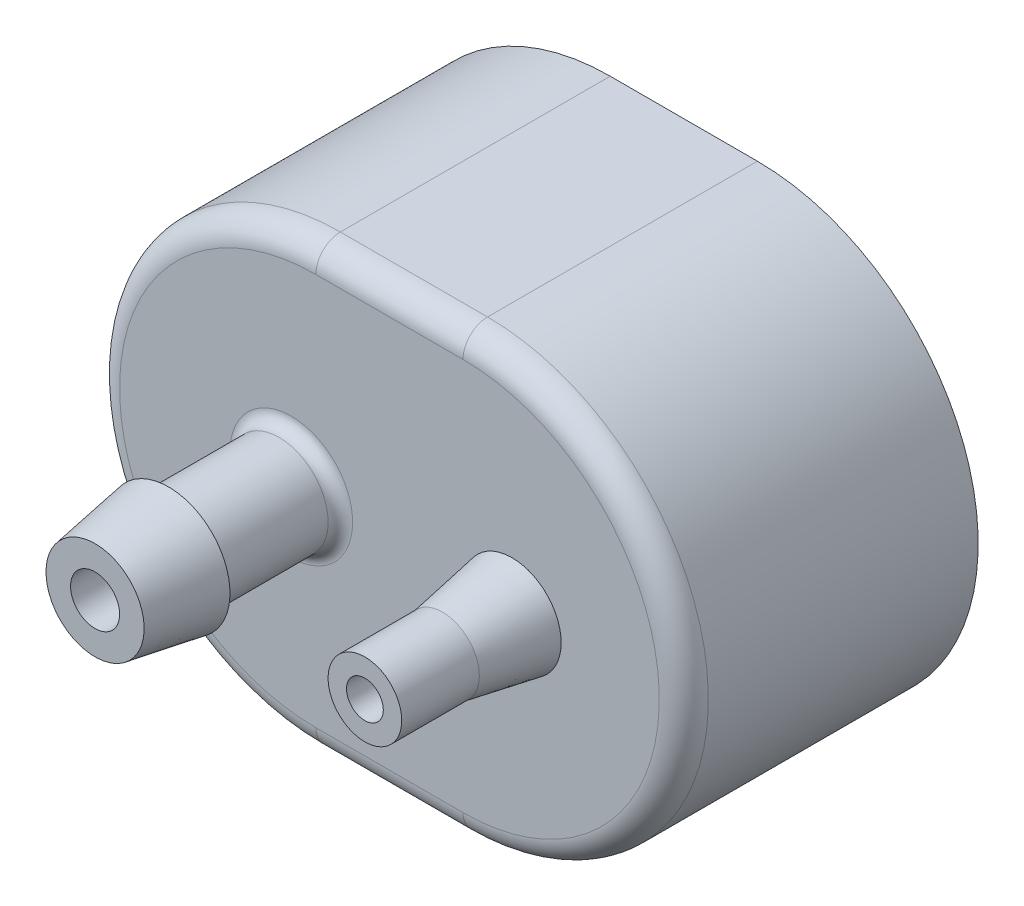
ISO-10303-21;
HEADER;
FILE_DESCRIPTION(('STEP AP214'),'2;1');
FILE_NAME('part.step','',(''),(''),'','','');
FILE_SCHEMA(('AUTOMOTIVE_DESIGN { 1 0 10303 214 1 1 1 1 }'));
ENDSEC;
DATA;
#1=APPLICATION_CONTEXT('core data for automotive mechanical design processes');
#2=APPLICATION_PROTOCOL_DEFINITION('international standard','automotive_design',2000,#1);
#3=PRODUCT_CONTEXT('',#1,'mechanical');
#4=PRODUCT('Part','Part','',(#3));
#5=PRODUCT_RELATED_PRODUCT_CATEGORY('part','',(#4));
#6=PRODUCT_DEFINITION_FORMATION('','',#4);
#7=PRODUCT_DEFINITION_CONTEXT('part definition',#1,'design');
#8=PRODUCT_DEFINITION('design','',#6,#7);
#9=PRODUCT_DEFINITION_SHAPE('','',#8);
#10=(LENGTH_UNIT() NAMED_UNIT(*) SI_UNIT(.MILLI.,.METRE.));
#11=(NAMED_UNIT(*) PLANE_ANGLE_UNIT() SI_UNIT($,.RADIAN.));
#12=(NAMED_UNIT(*) SI_UNIT($,.STERADIAN.) SOLID_ANGLE_UNIT());
#13=UNCERTAINTY_MEASURE_WITH_UNIT(LENGTH_MEASURE(1.E-05),#10,'distance_accuracy_value','');
#14=(GEOMETRIC_REPRESENTATION_CONTEXT(3) GLOBAL_UNCERTAINTY_ASSIGNED_CONTEXT((#13)) GLOBAL_UNIT_ASSIGNED_CONTEXT((#10,
#11,#12)) REPRESENTATION_CONTEXT('',''));
#15=CARTESIAN_POINT('',(0.,0.,0.));
#16=DIRECTION('',(0.,0.,1.));
#17=DIRECTION('',(1.,0.,0.));
#18=AXIS2_PLACEMENT_3D('',#15,#16,#17);
#19=CARTESIAN_POINT('',(8.00000000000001,0.,11.));
#20=DIRECTION('',(0.,0.,-1.));
#21=DIRECTION('',(-1.,0.,0.));
#22=AXIS2_PLACEMENT_3D('',#19,#20,#21);
#23=PLANE('',#22);
#24=CARTESIAN_POINT('',(8.00000000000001,0.,11.));
#25=DIRECTION('',(0.,0.,-1.));
#26=DIRECTION('',(-1.,0.,0.));
#27=AXIS2_PLACEMENT_3D('',#24,#25,#26);
#28=CIRCLE('',#27,0.75);
#29=CARTESIAN_POINT('',(8.70710678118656,0.25,11.));
#30=VERTEX_POINT('',#29);
#31=CARTESIAN_POINT('',(8.25000000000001,0.707106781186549,11.));
#32=VERTEX_POINT('',#31);
#33=EDGE_CURVE('E520',#30,#32,#28,.F.);
#34=ORIENTED_EDGE('',*,*,#33,.T.);
#35=DIRECTION('',(0.,-1.,0.));
#36=VECTOR('',#35,1.);
#37=CARTESIAN_POINT('',(8.25000000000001,0.70710678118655,11.));
#38=LINE('',#37,#36);
#39=CARTESIAN_POINT('',(8.25,1.98431348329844,11.));
#40=VERTEX_POINT('',#39);
#41=EDGE_CURVE('E51',#40,#32,#38,.T.);
#42=ORIENTED_EDGE('',*,*,#41,.F.);
#43=CARTESIAN_POINT('',(8.00000000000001,0.,11.));
#44=DIRECTION('',(0.,0.,-1.));
#45=DIRECTION('',(-1.,0.,0.));
#46=AXIS2_PLACEMENT_3D('',#43,#44,#45);
#47=CIRCLE('',#46,2.);
#48=CARTESIAN_POINT('',(9.98431348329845,0.25,11.));
#49=VERTEX_POINT('',#48);
#50=EDGE_CURVE('E240',#40,#49,#47,.T.);
#51=ORIENTED_EDGE('',*,*,#50,.T.);
#52=DIRECTION('',(1.,0.,0.));
#53=VECTOR('',#52,1.);
#54=CARTESIAN_POINT('',(8.70710678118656,0.25,11.));
#55=LINE('',#54,#53);
#56=EDGE_CURVE('E290',#30,#49,#55,.T.);
#57=ORIENTED_EDGE('',*,*,#56,.F.);
#58=EDGE_LOOP('',(#34,#42,#51,#57));
#59=FACE_BOUND('',#58,.T.);
#60=ADVANCED_FACE('F35',(#59),#23,.T.);
#61=CARTESIAN_POINT('',(6.01568651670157,0.25,11.));
#62=VERTEX_POINT('',#61);
#63=CARTESIAN_POINT('',(7.75,1.98431348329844,11.));
#64=VERTEX_POINT('',#63);
#65=EDGE_CURVE('E335',#62,#64,#47,.T.);
#66=ORIENTED_EDGE('',*,*,#65,.T.);
#67=DIRECTION('',(0.,1.,0.));
#68=VECTOR('',#67,1.);
#69=CARTESIAN_POINT('',(7.75000000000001,0.707106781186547,11.));
#70=LINE('',#69,#68);
#71=CARTESIAN_POINT('',(7.75000000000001,0.707106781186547,11.));
#72=VERTEX_POINT('',#71);
#73=EDGE_CURVE('E249',#72,#64,#70,.T.);
#74=ORIENTED_EDGE('',*,*,#73,.F.);
#75=CARTESIAN_POINT('',(7.29289321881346,0.25,11.));
#76=VERTEX_POINT('',#75);
#77=EDGE_CURVE('E337',#72,#76,#28,.F.);
#78=ORIENTED_EDGE('',*,*,#77,.T.);
#79=DIRECTION('',(1.,0.,0.));
#80=VECTOR('',#79,1.);
#81=CARTESIAN_POINT('',(6.01568651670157,0.25,11.));
#82=LINE('',#81,#80);
#83=EDGE_CURVE('E309',#62,#76,#82,.T.);
#84=ORIENTED_EDGE('',*,*,#83,.F.);
#85=EDGE_LOOP('',(#66,#74,#78,#84));
#86=FACE_BOUND('',#85,.T.);
#87=ADVANCED_FACE('F496',(#86),#23,.T.);
#88=CARTESIAN_POINT('',(8.00000000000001,0.,11.));
#89=DIRECTION('',(0.,0.,-1.));
#90=DIRECTION('',(-1.,0.,0.));
#91=AXIS2_PLACEMENT_3D('',#88,#89,#90);
#92=CYLINDRICAL_SURFACE('',#91,2.);
#93=DIRECTION('',(0.,0.,1.));
#94=VECTOR('',#93,1.);
#95=CARTESIAN_POINT('',(8.25,1.98431348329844,10.));
#96=LINE('',#95,#94);
#97=CARTESIAN_POINT('',(8.25,1.98431348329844,10.));
#98=VERTEX_POINT('',#97);
#99=EDGE_CURVE('E238',#98,#40,#96,.T.);
#100=ORIENTED_EDGE('',*,*,#99,.F.);
#101=CARTESIAN_POINT('',(8.00000000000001,0.,10.));
#102=DIRECTION('',(0.,0.,-1.));
#103=DIRECTION('',(-1.,0.,0.));
#104=AXIS2_PLACEMENT_3D('',#101,#102,#103);
#105=CIRCLE('',#104,2.);
#106=CARTESIAN_POINT('',(9.98431348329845,0.25,10.));
#107=VERTEX_POINT('',#106);
#108=EDGE_CURVE('E221',#98,#107,#105,.T.);
#109=ORIENTED_EDGE('',*,*,#108,.T.);
#110=DIRECTION('',(0.,0.,1.));
#111=VECTOR('',#110,1.);
#112=CARTESIAN_POINT('',(9.98431348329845,0.25,10.));
#113=LINE('',#112,#111);
#114=EDGE_CURVE('E298',#107,#49,#113,.T.);
#115=ORIENTED_EDGE('',*,*,#114,.T.);
#116=ORIENTED_EDGE('',*,*,#50,.F.);
#117=EDGE_LOOP('',(#100,#109,#115,#116));
#118=FACE_BOUND('',#117,.T.);
#119=ADVANCED_FACE('F239',(#118),#92,.F.);
#120=DIRECTION('',(0.,0.,1.));
#121=VECTOR('',#120,1.);
#122=CARTESIAN_POINT('',(7.75,1.98431348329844,10.));
#123=LINE('',#122,#121);
#124=CARTESIAN_POINT('',(7.75,1.98431348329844,10.));
#125=VERTEX_POINT('',#124);
#126=EDGE_CURVE('E59',#125,#64,#123,.T.);
#127=ORIENTED_EDGE('',*,*,#126,.T.);
#128=ORIENTED_EDGE('',*,*,#65,.F.);
#129=DIRECTION('',(0.,0.,1.));
#130=VECTOR('',#129,1.);
#131=CARTESIAN_POINT('',(6.01568651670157,0.25,10.));
#132=LINE('',#131,#130);
#133=CARTESIAN_POINT('',(6.01568651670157,0.25,10.));
#134=VERTEX_POINT('',#133);
#135=EDGE_CURVE('E331',#134,#62,#132,.T.);
#136=ORIENTED_EDGE('',*,*,#135,.F.);
#137=EDGE_CURVE('E233',#134,#125,#105,.T.);
#138=ORIENTED_EDGE('',*,*,#137,.T.);
#139=EDGE_LOOP('',(#127,#128,#136,#138));
#140=FACE_BOUND('',#139,.T.);
#141=ADVANCED_FACE('F506',(#140),#92,.F.);
#142=CARTESIAN_POINT('',(7.29289321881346,-0.25,11.));
#143=VERTEX_POINT('',#142);
#144=CARTESIAN_POINT('',(7.75000000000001,-0.707106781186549,11.));
#145=VERTEX_POINT('',#144);
#146=EDGE_CURVE('E39',#143,#145,#28,.F.);
#147=ORIENTED_EDGE('',*,*,#146,.T.);
#148=DIRECTION('',(0.,1.,0.));
#149=VECTOR('',#148,1.);
#150=CARTESIAN_POINT('',(7.75000000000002,-1.98431348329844,11.));
#151=LINE('',#150,#149);
#152=CARTESIAN_POINT('',(7.75000000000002,-1.98431348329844,11.));
#153=VERTEX_POINT('',#152);
#154=EDGE_CURVE('E242',#153,#145,#151,.T.);
#155=ORIENTED_EDGE('',*,*,#154,.F.);
#156=CARTESIAN_POINT('',(6.01568651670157,-0.25,11.));
#157=VERTEX_POINT('',#156);
#158=EDGE_CURVE('E334',#153,#157,#47,.T.);
#159=ORIENTED_EDGE('',*,*,#158,.T.);
#160=DIRECTION('',(-1.,0.,0.));
#161=VECTOR('',#160,1.);
#162=CARTESIAN_POINT('',(6.01568651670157,-0.25,11.));
#163=LINE('',#162,#161);
#164=EDGE_CURVE('E312',#143,#157,#163,.T.);
#165=ORIENTED_EDGE('',*,*,#164,.F.);
#166=EDGE_LOOP('',(#147,#155,#159,#165));
#167=FACE_BOUND('',#166,.T.);
#168=ADVANCED_FACE('F498',(#167),#23,.T.);
#169=CARTESIAN_POINT('',(9.98431348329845,-0.250000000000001,11.));
#170=VERTEX_POINT('',#169);
#171=CARTESIAN_POINT('',(8.25000000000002,-1.98431348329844,11.));
#172=VERTEX_POINT('',#171);
#173=EDGE_CURVE('E338',#170,#172,#47,.T.);
#174=ORIENTED_EDGE('',*,*,#173,.T.);
#175=DIRECTION('',(0.,-1.,0.));
#176=VECTOR('',#175,1.);
#177=CARTESIAN_POINT('',(8.25000000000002,-1.98431348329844,11.));
#178=LINE('',#177,#176);
#179=CARTESIAN_POINT('',(8.25000000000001,-0.707106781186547,11.));
#180=VERTEX_POINT('',#179);
#181=EDGE_CURVE('E266',#180,#172,#178,.T.);
#182=ORIENTED_EDGE('',*,*,#181,.F.);
#183=CARTESIAN_POINT('',(8.70710678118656,-0.249999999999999,11.));
#184=VERTEX_POINT('',#183);
#185=EDGE_CURVE('E519',#180,#184,#28,.F.);
#186=ORIENTED_EDGE('',*,*,#185,.T.);
#187=DIRECTION('',(-1.,0.,0.));
#188=VECTOR('',#187,1.);
#189=CARTESIAN_POINT('',(8.70710678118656,-0.25,11.));
#190=LINE('',#189,#188);
#191=EDGE_CURVE('E287',#170,#184,#190,.T.);
#192=ORIENTED_EDGE('',*,*,#191,.F.);
#193=EDGE_LOOP('',(#174,#182,#186,#192));
#194=FACE_BOUND('',#193,.T.);
#195=ADVANCED_FACE('F503',(#194),#23,.T.);
#196=DIRECTION('',(0.,0.,1.));
#197=VECTOR('',#196,1.);
#198=CARTESIAN_POINT('',(7.75000000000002,-1.98431348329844,10.));
#199=LINE('',#198,#197);
#200=CARTESIAN_POINT('',(7.75000000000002,-1.98431348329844,10.));
#201=VERTEX_POINT('',#200);
#202=EDGE_CURVE('E284',#201,#153,#199,.T.);
#203=ORIENTED_EDGE('',*,*,#202,.F.);
#204=CARTESIAN_POINT('',(6.01568651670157,-0.25,10.));
#205=VERTEX_POINT('',#204);
#206=EDGE_CURVE('E236',#201,#205,#105,.T.);
#207=ORIENTED_EDGE('',*,*,#206,.T.);
#208=DIRECTION('',(0.,0.,1.));
#209=VECTOR('',#208,1.);
#210=CARTESIAN_POINT('',(6.01568651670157,-0.25,10.));
#211=LINE('',#210,#209);
#212=EDGE_CURVE('E322',#205,#157,#211,.T.);
#213=ORIENTED_EDGE('',*,*,#212,.T.);
#214=ORIENTED_EDGE('',*,*,#158,.F.);
#215=EDGE_LOOP('',(#203,#207,#213,#214));
#216=FACE_BOUND('',#215,.T.);
#217=ADVANCED_FACE('F512',(#216),#92,.F.);
#218=DIRECTION('',(0.,0.,1.));
#219=VECTOR('',#218,1.);
#220=CARTESIAN_POINT('',(8.25000000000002,-1.98431348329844,10.));
#221=LINE('',#220,#219);
#222=CARTESIAN_POINT('',(8.25000000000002,-1.98431348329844,10.));
#223=VERTEX_POINT('',#222);
#224=EDGE_CURVE('E276',#223,#172,#221,.T.);
#225=ORIENTED_EDGE('',*,*,#224,.T.);
#226=ORIENTED_EDGE('',*,*,#173,.F.);
#227=DIRECTION('',(0.,0.,1.));
#228=VECTOR('',#227,1.);
#229=CARTESIAN_POINT('',(9.98431348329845,-0.25,10.));
#230=LINE('',#229,#228);
#231=CARTESIAN_POINT('',(9.98431348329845,-0.25,10.));
#232=VERTEX_POINT('',#231);
#233=EDGE_CURVE('E306',#232,#170,#230,.T.);
#234=ORIENTED_EDGE('',*,*,#233,.F.);
#235=EDGE_CURVE('E234',#232,#223,#105,.T.);
#236=ORIENTED_EDGE('',*,*,#235,.T.);
#237=EDGE_LOOP('',(#225,#226,#234,#236));
#238=FACE_BOUND('',#237,.T.);
#239=ADVANCED_FACE('F514',(#238),#92,.F.);
#240=CARTESIAN_POINT('',(8.00000000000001,0.,0.));
#241=DIRECTION('',(0.,0.,1.));
#242=DIRECTION('',(1.,0.,0.));
#243=AXIS2_PLACEMENT_3D('',#240,#241,#242);
#244=CYLINDRICAL_SURFACE('',#243,0.75);
#245=CARTESIAN_POINT('',(8.00000000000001,0.,18.));
#246=DIRECTION('',(0.,0.,1.));
#247=DIRECTION('',(1.,0.,0.));
#248=AXIS2_PLACEMENT_3D('',#245,#246,#247);
#249=CIRCLE('',#248,0.75);
#250=CARTESIAN_POINT('',(8.75000000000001,0.,18.));
#251=VERTEX_POINT('',#250);
#252=EDGE_CURVE('E339',#251,#251,#249,.T.);
#253=ORIENTED_EDGE('',*,*,#252,.T.);
#254=EDGE_LOOP('',(#253));
#255=FACE_BOUND('',#254,.T.);
#256=ORIENTED_EDGE('',*,*,#146,.F.);
#257=DIRECTION('',(0.,0.,1.));
#258=VECTOR('',#257,1.);
#259=CARTESIAN_POINT('',(7.29289321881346,-0.25,10.));
#260=LINE('',#259,#258);
#261=CARTESIAN_POINT('',(7.29289321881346,-0.25,10.));
#262=VERTEX_POINT('',#261);
#263=EDGE_CURVE('E325',#262,#143,#260,.T.);
#264=ORIENTED_EDGE('',*,*,#263,.F.);
#265=CARTESIAN_POINT('',(8.00000000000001,0.,10.));
#266=DIRECTION('',(0.,0.,1.));
#267=DIRECTION('',(-1.,0.,0.));
#268=AXIS2_PLACEMENT_3D('',#265,#266,#267);
#269=CIRCLE('',#268,0.75);
#270=CARTESIAN_POINT('',(7.29289321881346,0.25,10.));
#271=VERTEX_POINT('',#270);
#272=EDGE_CURVE('E317',#271,#262,#269,.T.);
#273=ORIENTED_EDGE('',*,*,#272,.F.);
#274=DIRECTION('',(0.,0.,1.));
#275=VECTOR('',#274,1.);
#276=CARTESIAN_POINT('',(7.29289321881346,0.25,10.));
#277=LINE('',#276,#275);
#278=EDGE_CURVE('E328',#271,#76,#277,.T.);
#279=ORIENTED_EDGE('',*,*,#278,.T.);
#280=ORIENTED_EDGE('',*,*,#77,.F.);
#281=DIRECTION('',(0.,0.,1.));
#282=VECTOR('',#281,1.);
#283=CARTESIAN_POINT('',(7.75000000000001,0.707106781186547,10.));
#284=LINE('',#283,#282);
#285=CARTESIAN_POINT('',(7.75000000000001,0.707106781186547,10.));
#286=VERTEX_POINT('',#285);
#287=EDGE_CURVE('E260',#286,#72,#284,.T.);
#288=ORIENTED_EDGE('',*,*,#287,.F.);
#289=CARTESIAN_POINT('',(8.00000000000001,0.,10.));
#290=DIRECTION('',(0.,0.,1.));
#291=DIRECTION('',(0.,-1.,0.));
#292=AXIS2_PLACEMENT_3D('',#289,#290,#291);
#293=CIRCLE('',#292,0.750000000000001);
#294=CARTESIAN_POINT('',(8.25000000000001,0.70710678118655,10.));
#295=VERTEX_POINT('',#294);
#296=EDGE_CURVE('E248',#295,#286,#293,.T.);
#297=ORIENTED_EDGE('',*,*,#296,.F.);
#298=DIRECTION('',(0.,0.,1.));
#299=VECTOR('',#298,1.);
#300=CARTESIAN_POINT('',(8.25000000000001,0.70710678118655,10.));
#301=LINE('',#300,#299);
#302=EDGE_CURVE('E243',#295,#32,#301,.T.);
#303=ORIENTED_EDGE('',*,*,#302,.T.);
#304=ORIENTED_EDGE('',*,*,#33,.F.);
#305=DIRECTION('',(0.,0.,1.));
#306=VECTOR('',#305,1.);
#307=CARTESIAN_POINT('',(8.70710678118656,0.25,10.));
#308=LINE('',#307,#306);
#309=CARTESIAN_POINT('',(8.70710678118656,0.25,10.));
#310=VERTEX_POINT('',#309);
#311=EDGE_CURVE('E300',#310,#30,#308,.T.);
#312=ORIENTED_EDGE('',*,*,#311,.F.);
#313=CARTESIAN_POINT('',(8.00000000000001,0.,10.));
#314=DIRECTION('',(0.,0.,1.));
#315=DIRECTION('',(-1.,0.,0.));
#316=AXIS2_PLACEMENT_3D('',#313,#314,#315);
#317=CIRCLE('',#316,0.750000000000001);
#318=CARTESIAN_POINT('',(8.70710678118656,-0.25,10.));
#319=VERTEX_POINT('',#318);
#320=EDGE_CURVE('E295',#319,#310,#317,.T.);
#321=ORIENTED_EDGE('',*,*,#320,.F.);
#322=DIRECTION('',(0.,0.,1.));
#323=VECTOR('',#322,1.);
#324=CARTESIAN_POINT('',(8.70710678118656,-0.25,10.));
#325=LINE('',#324,#323);
#326=EDGE_CURVE('E303',#319,#184,#325,.T.);
#327=ORIENTED_EDGE('',*,*,#326,.T.);
#328=ORIENTED_EDGE('',*,*,#185,.F.);
#329=DIRECTION('',(0.,0.,1.));
#330=VECTOR('',#329,1.);
#331=CARTESIAN_POINT('',(8.25000000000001,-0.707106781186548,10.));
#332=LINE('',#331,#330);
#333=CARTESIAN_POINT('',(8.25000000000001,-0.707106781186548,10.));
#334=VERTEX_POINT('',#333);
#335=EDGE_CURVE('E278',#334,#180,#332,.T.);
#336=ORIENTED_EDGE('',*,*,#335,.F.);
#337=CARTESIAN_POINT('',(8.00000000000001,0.,10.));
#338=DIRECTION('',(0.,0.,1.));
#339=DIRECTION('',(0.,-1.,0.));
#340=AXIS2_PLACEMENT_3D('',#337,#338,#339);
#341=CIRCLE('',#340,0.75);
#342=CARTESIAN_POINT('',(7.75000000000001,-0.707106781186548,10.));
#343=VERTEX_POINT('',#342);
#344=EDGE_CURVE('E271',#343,#334,#341,.T.);
#345=ORIENTED_EDGE('',*,*,#344,.F.);
#346=DIRECTION('',(0.,0.,1.));
#347=VECTOR('',#346,1.);
#348=CARTESIAN_POINT('',(7.75000000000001,-0.707106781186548,10.));
#349=LINE('',#348,#347);
#350=EDGE_CURVE('E281',#343,#145,#349,.T.);
#351=ORIENTED_EDGE('',*,*,#350,.T.);
#352=EDGE_LOOP('',(#256,#264,#273,#279,#280,#288,#297,#303,#304,#312,#321,#327,#328,#336,#345,#351));
#353=FACE_BOUND('',#352,.T.);
#354=ADVANCED_FACE('F527',(#255,#353),#244,.F.);
#355=CARTESIAN_POINT('',(0.,0.,12.));
#356=DIRECTION('',(0.,0.,1.));
#357=DIRECTION('',(1.,0.,0.));
#358=AXIS2_PLACEMENT_3D('',#355,#356,#357);
#359=PLANE('',#358);
#360=CARTESIAN_POINT('',(8.,0.,12.));
#361=DIRECTION('',(0.,0.,1.));
#362=DIRECTION('',(1.,0.,0.));
#363=AXIS2_PLACEMENT_3D('',#360,#361,#362);
#364=CIRCLE('',#363,2.);
#365=CARTESIAN_POINT('',(10.,0.,12.));
#366=VERTEX_POINT('',#365);
#367=EDGE_CURVE('E11',#366,#366,#364,.F.);
#368=ORIENTED_EDGE('',*,*,#367,.T.);
#369=EDGE_LOOP('',(#368));
#370=FACE_BOUND('',#369,.T.);
#371=DIRECTION('',(-1.,0.,0.));
#372=VECTOR('',#371,1.);
#373=CARTESIAN_POINT('',(0.,8.,12.));
#374=LINE('',#373,#372);
#375=CARTESIAN_POINT('',(6.00000000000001,8.,12.));
#376=VERTEX_POINT('',#375);
#377=CARTESIAN_POINT('',(0.,8.,12.));
#378=VERTEX_POINT('',#377);
#379=EDGE_CURVE('E432',#376,#378,#374,.T.);
#380=ORIENTED_EDGE('',*,*,#379,.T.);
#381=CARTESIAN_POINT('',(0.,0.,12.));
#382=DIRECTION('',(0.,0.,1.));
#383=DIRECTION('',(1.,0.,0.));
#384=AXIS2_PLACEMENT_3D('',#381,#382,#383);
#385=CIRCLE('',#384,8.);
#386=CARTESIAN_POINT('',(0.,-8.,12.));
#387=VERTEX_POINT('',#386);
#388=EDGE_CURVE('E436',#378,#387,#385,.T.);
#389=ORIENTED_EDGE('',*,*,#388,.T.);
#390=DIRECTION('',(1.,0.,0.));
#391=VECTOR('',#390,1.);
#392=CARTESIAN_POINT('',(6.00000000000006,-8.,12.));
#393=LINE('',#392,#391);
#394=CARTESIAN_POINT('',(6.00000000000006,-8.,12.));
#395=VERTEX_POINT('',#394);
#396=EDGE_CURVE('E434',#387,#395,#393,.T.);
#397=ORIENTED_EDGE('',*,*,#396,.T.);
#398=CARTESIAN_POINT('',(6.00000000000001,0.,12.));
#399=DIRECTION('',(0.,0.,1.));
#400=DIRECTION('',(1.,0.,0.));
#401=AXIS2_PLACEMENT_3D('',#398,#399,#400);
#402=CIRCLE('',#401,8.);
#403=EDGE_CURVE('E430',#395,#376,#402,.T.);
#404=ORIENTED_EDGE('',*,*,#403,.T.);
#405=EDGE_LOOP('',(#380,#389,#397,#404));
#406=FACE_BOUND('',#405,.T.);
#407=CARTESIAN_POINT('',(-0.999999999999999,0.,12.));
#408=DIRECTION('',(0.,0.,1.));
#409=DIRECTION('',(1.,0.,0.));
#410=AXIS2_PLACEMENT_3D('',#407,#408,#409);
#411=CIRCLE('',#410,2.50000000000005);
#412=CARTESIAN_POINT('',(1.50000000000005,0.,12.));
#413=VERTEX_POINT('',#412);
#414=EDGE_CURVE('E469',#413,#413,#411,.F.);
#415=ORIENTED_EDGE('',*,*,#414,.T.);
#416=EDGE_LOOP('',(#415));
#417=FACE_BOUND('',#416,.T.);
#418=ADVANCED_FACE('F613',(#370,#406,#417),#359,.T.);
#419=CARTESIAN_POINT('',(6.00000000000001,0.,10.));
#420=DIRECTION('',(0.,0.,-1.));
#421=DIRECTION('',(-1.,0.,0.));
#422=AXIS2_PLACEMENT_3D('',#419,#420,#421);
#423=PLANE('',#422);
#424=ORIENTED_EDGE('',*,*,#137,.F.);
#425=DIRECTION('',(1.,0.,0.));
#426=VECTOR('',#425,1.);
#427=CARTESIAN_POINT('',(6.01568651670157,0.25,10.));
#428=LINE('',#427,#426);
#429=EDGE_CURVE('E315',#134,#271,#428,.T.);
#430=ORIENTED_EDGE('',*,*,#429,.T.);
#431=ORIENTED_EDGE('',*,*,#272,.T.);
#432=DIRECTION('',(-1.,0.,0.));
#433=VECTOR('',#432,1.);
#434=CARTESIAN_POINT('',(6.01568651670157,-0.25,10.));
#435=LINE('',#434,#433);
#436=EDGE_CURVE('E319',#262,#205,#435,.T.);
#437=ORIENTED_EDGE('',*,*,#436,.T.);
#438=ORIENTED_EDGE('',*,*,#206,.F.);
#439=DIRECTION('',(0.,1.,0.));
#440=VECTOR('',#439,1.);
#441=CARTESIAN_POINT('',(7.75000000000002,-1.98431348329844,10.));
#442=LINE('',#441,#440);
#443=EDGE_CURVE('E269',#201,#343,#442,.T.);
#444=ORIENTED_EDGE('',*,*,#443,.T.);
#445=ORIENTED_EDGE('',*,*,#344,.T.);
#446=DIRECTION('',(0.,-1.,0.));
#447=VECTOR('',#446,1.);
#448=CARTESIAN_POINT('',(8.25000000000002,-1.98431348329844,10.));
#449=LINE('',#448,#447);
#450=EDGE_CURVE('E273',#334,#223,#449,.T.);
#451=ORIENTED_EDGE('',*,*,#450,.T.);
#452=ORIENTED_EDGE('',*,*,#235,.F.);
#453=DIRECTION('',(-1.,0.,0.));
#454=VECTOR('',#453,1.);
#455=CARTESIAN_POINT('',(8.70710678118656,-0.25,10.));
#456=LINE('',#455,#454);
#457=EDGE_CURVE('E293',#232,#319,#456,.T.);
#458=ORIENTED_EDGE('',*,*,#457,.T.);
#459=ORIENTED_EDGE('',*,*,#320,.T.);
#460=DIRECTION('',(1.,0.,0.));
#461=VECTOR('',#460,1.);
#462=CARTESIAN_POINT('',(8.70710678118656,0.25,10.));
#463=LINE('',#462,#461);
#464=EDGE_CURVE('E229',#310,#107,#463,.T.);
#465=ORIENTED_EDGE('',*,*,#464,.T.);
#466=ORIENTED_EDGE('',*,*,#108,.F.);
#467=DIRECTION('',(0.,-1.,0.));
#468=VECTOR('',#467,1.);
#469=CARTESIAN_POINT('',(8.25000000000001,0.70710678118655,10.));
#470=LINE('',#469,#468);
#471=EDGE_CURVE('E226',#98,#295,#470,.T.);
#472=ORIENTED_EDGE('',*,*,#471,.T.);
#473=ORIENTED_EDGE('',*,*,#296,.T.);
#474=DIRECTION('',(0.,1.,0.));
#475=VECTOR('',#474,1.);
#476=CARTESIAN_POINT('',(7.75000000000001,0.707106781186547,10.));
#477=LINE('',#476,#475);
#478=EDGE_CURVE('E251',#286,#125,#477,.T.);
#479=ORIENTED_EDGE('',*,*,#478,.T.);
#480=EDGE_LOOP('',(#424,#430,#431,#437,#438,#444,#445,#451,#452,#458,#459,#465,#466,#472,#473,#479));
#481=FACE_BOUND('',#480,.T.);
#482=CARTESIAN_POINT('',(6.00000000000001,0.,10.));
#483=DIRECTION('',(0.,0.,-1.));
#484=DIRECTION('',(-1.,0.,0.));
#485=AXIS2_PLACEMENT_3D('',#482,#483,#484);
#486=CIRCLE('',#485,7.);
#487=CARTESIAN_POINT('',(6.00000000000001,7.,10.));
#488=VERTEX_POINT('',#487);
#489=CARTESIAN_POINT('',(6.00000000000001,-7.,10.));
#490=VERTEX_POINT('',#489);
#491=EDGE_CURVE('E386',#488,#490,#486,.T.);
#492=ORIENTED_EDGE('',*,*,#491,.T.);
#493=DIRECTION('',(-1.,0.,0.));
#494=VECTOR('',#493,1.);
#495=CARTESIAN_POINT('',(6.00000000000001,-7.,10.));
#496=LINE('',#495,#494);
#497=CARTESIAN_POINT('',(0.,-7.00000000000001,10.));
#498=VERTEX_POINT('',#497);
#499=EDGE_CURVE('E389',#490,#498,#496,.T.);
#500=ORIENTED_EDGE('',*,*,#499,.T.);
#501=CARTESIAN_POINT('',(0.,0.,10.));
#502=DIRECTION('',(0.,0.,-1.));
#503=DIRECTION('',(-1.,0.,0.));
#504=AXIS2_PLACEMENT_3D('',#501,#502,#503);
#505=CIRCLE('',#504,7.00000000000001);
#506=CARTESIAN_POINT('',(0.,7.00000000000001,10.));
#507=VERTEX_POINT('',#506);
#508=EDGE_CURVE('E392',#498,#507,#505,.T.);
#509=ORIENTED_EDGE('',*,*,#508,.T.);
#510=DIRECTION('',(1.,0.,0.));
#511=VECTOR('',#510,1.);
#512=CARTESIAN_POINT('',(6.00000000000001,7.,10.));
#513=LINE('',#512,#511);
#514=EDGE_CURVE('E395',#507,#488,#513,.T.);
#515=ORIENTED_EDGE('',*,*,#514,.T.);
#516=EDGE_LOOP('',(#492,#500,#509,#515));
#517=FACE_BOUND('',#516,.T.);
#518=CARTESIAN_POINT('',(0.,0.,10.));
#519=DIRECTION('',(0.,0.,-1.));
#520=DIRECTION('',(-1.,0.,0.));
#521=AXIS2_PLACEMENT_3D('',#518,#519,#520);
#522=CIRCLE('',#521,3.);
#523=CARTESIAN_POINT('',(-3.,0.,10.));
#524=VERTEX_POINT('',#523);
#525=EDGE_CURVE('E360',#524,#524,#522,.T.);
#526=ORIENTED_EDGE('',*,*,#525,.F.);
#527=EDGE_LOOP('',(#526));
#528=FACE_BOUND('',#527,.T.);
#529=ADVANCED_FACE('F223',(#481,#517,#528),#423,.T.);
#530=CARTESIAN_POINT('',(0.,0.,12.));
#531=DIRECTION('',(0.,0.,-1.));
#532=DIRECTION('',(-1.,0.,0.));
#533=AXIS2_PLACEMENT_3D('',#530,#531,#532);
#534=CYLINDRICAL_SURFACE('',#533,9.);
#535=DIRECTION('',(0.,0.,-1.));
#536=VECTOR('',#535,1.);
#537=CARTESIAN_POINT('',(0.,-9.,12.));
#538=LINE('',#537,#536);
#539=CARTESIAN_POINT('',(0.,-9.,11.));
#540=VERTEX_POINT('',#539);
#541=CARTESIAN_POINT('',(0.,-9.,0.));
#542=VERTEX_POINT('',#541);
#543=EDGE_CURVE('E428',#540,#542,#538,.T.);
#544=ORIENTED_EDGE('',*,*,#543,.F.);
#545=CARTESIAN_POINT('',(0.,0.,11.));
#546=DIRECTION('',(0.,0.,1.));
#547=DIRECTION('',(1.,0.,0.));
#548=AXIS2_PLACEMENT_3D('',#545,#546,#547);
#549=CIRCLE('',#548,9.);
#550=CARTESIAN_POINT('',(0.,9.,11.));
#551=VERTEX_POINT('',#550);
#552=EDGE_CURVE('E439',#540,#551,#549,.F.);
#553=ORIENTED_EDGE('',*,*,#552,.T.);
#554=DIRECTION('',(0.,0.,-1.));
#555=VECTOR('',#554,1.);
#556=CARTESIAN_POINT('',(0.,9.,12.));
#557=LINE('',#556,#555);
#558=CARTESIAN_POINT('',(0.,9.,0.));
#559=VERTEX_POINT('',#558);
#560=EDGE_CURVE('E422',#551,#559,#557,.T.);
#561=ORIENTED_EDGE('',*,*,#560,.T.);
#562=CARTESIAN_POINT('',(0.,0.,0.));
#563=DIRECTION('',(0.,0.,1.));
#564=DIRECTION('',(1.,0.,0.));
#565=AXIS2_PLACEMENT_3D('',#562,#563,#564);
#566=CIRCLE('',#565,9.);
#567=EDGE_CURVE('E402',#559,#542,#566,.T.);
#568=ORIENTED_EDGE('',*,*,#567,.T.);
#569=EDGE_LOOP('',(#544,#553,#561,#568));
#570=FACE_BOUND('',#569,.T.);
#571=ADVANCED_FACE('F37',(#570),#534,.T.);
#572=CARTESIAN_POINT('',(0.,-9.,12.));
#573=DIRECTION('',(0.,1.,0.));
#574=DIRECTION('',(0.,0.,1.));
#575=AXIS2_PLACEMENT_3D('',#572,#573,#574);
#576=PLANE('',#575);
#577=DIRECTION('',(0.,0.,-1.));
#578=VECTOR('',#577,1.);
#579=CARTESIAN_POINT('',(6.00000000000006,-9.,12.));
#580=LINE('',#579,#578);
#581=CARTESIAN_POINT('',(6.00000000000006,-9.,11.));
#582=VERTEX_POINT('',#581);
#583=CARTESIAN_POINT('',(6.00000000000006,-9.,0.));
#584=VERTEX_POINT('',#583);
#585=EDGE_CURVE('E426',#582,#584,#580,.T.);
#586=ORIENTED_EDGE('',*,*,#585,.F.);
#587=DIRECTION('',(1.,0.,0.));
#588=VECTOR('',#587,1.);
#589=CARTESIAN_POINT('',(0.,-9.,11.));
#590=LINE('',#589,#588);
#591=EDGE_CURVE('E442',#582,#540,#590,.F.);
#592=ORIENTED_EDGE('',*,*,#591,.T.);
#593=ORIENTED_EDGE('',*,*,#543,.T.);
#594=DIRECTION('',(1.,0.,0.));
#595=VECTOR('',#594,1.);
#596=CARTESIAN_POINT('',(0.,-9.,0.));
#597=LINE('',#596,#595);
#598=EDGE_CURVE('E413',#542,#584,#597,.T.);
#599=ORIENTED_EDGE('',*,*,#598,.T.);
#600=EDGE_LOOP('',(#586,#592,#593,#599));
#601=FACE_BOUND('',#600,.T.);
#602=ADVANCED_FACE('F631',(#601),#576,.F.);
#603=CARTESIAN_POINT('',(6.00000000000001,0.,12.));
#604=DIRECTION('',(0.,0.,-1.));
#605=DIRECTION('',(-1.,0.,0.));
#606=AXIS2_PLACEMENT_3D('',#603,#604,#605);
#607=CYLINDRICAL_SURFACE('',#606,9.);
#608=DIRECTION('',(0.,0.,-1.));
#609=VECTOR('',#608,1.);
#610=CARTESIAN_POINT('',(6.00000000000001,9.,12.));
#611=LINE('',#610,#609);
#612=CARTESIAN_POINT('',(6.00000000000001,9.,11.));
#613=VERTEX_POINT('',#612);
#614=CARTESIAN_POINT('',(6.00000000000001,9.,0.));
#615=VERTEX_POINT('',#614);
#616=EDGE_CURVE('E424',#613,#615,#611,.T.);
#617=ORIENTED_EDGE('',*,*,#616,.F.);
#618=CARTESIAN_POINT('',(6.00000000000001,0.,11.));
#619=DIRECTION('',(0.,0.,1.));
#620=DIRECTION('',(1.,0.,0.));
#621=AXIS2_PLACEMENT_3D('',#618,#619,#620);
#622=CIRCLE('',#621,9.);
#623=EDGE_CURVE('E446',#613,#582,#622,.F.);
#624=ORIENTED_EDGE('',*,*,#623,.T.);
#625=ORIENTED_EDGE('',*,*,#585,.T.);
#626=CARTESIAN_POINT('',(6.00000000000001,0.,0.));
#627=DIRECTION('',(0.,0.,1.));
#628=DIRECTION('',(1.,0.,0.));
#629=AXIS2_PLACEMENT_3D('',#626,#627,#628);
#630=CIRCLE('',#629,9.);
#631=EDGE_CURVE('E416',#584,#615,#630,.T.);
#632=ORIENTED_EDGE('',*,*,#631,.T.);
#633=EDGE_LOOP('',(#617,#624,#625,#632));
#634=FACE_BOUND('',#633,.T.);
#635=ADVANCED_FACE('F641',(#634),#607,.T.);
#636=CARTESIAN_POINT('',(0.,9.,12.));
#637=DIRECTION('',(0.,-1.,0.));
#638=DIRECTION('',(0.,0.,-1.));
#639=AXIS2_PLACEMENT_3D('',#636,#637,#638);
#640=PLANE('',#639);
#641=ORIENTED_EDGE('',*,*,#560,.F.);
#642=DIRECTION('',(-1.,0.,0.));
#643=VECTOR('',#642,1.);
#644=CARTESIAN_POINT('',(6.00000000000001,9.,11.));
#645=LINE('',#644,#643);
#646=EDGE_CURVE('E444',#551,#613,#645,.F.);
#647=ORIENTED_EDGE('',*,*,#646,.T.);
#648=ORIENTED_EDGE('',*,*,#616,.T.);
#649=DIRECTION('',(-1.,0.,0.));
#650=VECTOR('',#649,1.);
#651=CARTESIAN_POINT('',(0.,9.,0.));
#652=LINE('',#651,#650);
#653=EDGE_CURVE('E419',#615,#559,#652,.T.);
#654=ORIENTED_EDGE('',*,*,#653,.T.);
#655=EDGE_LOOP('',(#641,#647,#648,#654));
#656=FACE_BOUND('',#655,.T.);
#657=ADVANCED_FACE('F651',(#656),#640,.F.);
#658=CARTESIAN_POINT('',(0.,0.,0.));
#659=DIRECTION('',(0.,0.,1.));
#660=DIRECTION('',(1.,0.,0.));
#661=AXIS2_PLACEMENT_3D('',#658,#659,#660);
#662=PLANE('',#661);
#663=DIRECTION('',(1.,0.,0.));
#664=VECTOR('',#663,1.);
#665=CARTESIAN_POINT('',(0.,-8.00000000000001,0.));
#666=LINE('',#665,#664);
#667=CARTESIAN_POINT('',(0.,-8.00000000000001,0.));
#668=VERTEX_POINT('',#667);
#669=CARTESIAN_POINT('',(6.00000000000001,-8.,0.));
#670=VERTEX_POINT('',#669);
#671=EDGE_CURVE('E455',#668,#670,#666,.T.);
#672=ORIENTED_EDGE('',*,*,#671,.T.);
#673=CARTESIAN_POINT('',(6.00000000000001,0.,0.));
#674=DIRECTION('',(0.,0.,1.));
#675=DIRECTION('',(1.,0.,0.));
#676=AXIS2_PLACEMENT_3D('',#673,#674,#675);
#677=CIRCLE('',#676,8.);
#678=CARTESIAN_POINT('',(6.00000000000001,8.,0.));
#679=VERTEX_POINT('',#678);
#680=EDGE_CURVE('E457',#670,#679,#677,.T.);
#681=ORIENTED_EDGE('',*,*,#680,.T.);
#682=DIRECTION('',(-1.,0.,0.));
#683=VECTOR('',#682,1.);
#684=CARTESIAN_POINT('',(0.,8.00000000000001,0.));
#685=LINE('',#684,#683);
#686=CARTESIAN_POINT('',(0.,8.00000000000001,0.));
#687=VERTEX_POINT('',#686);
#688=EDGE_CURVE('E453',#679,#687,#685,.T.);
#689=ORIENTED_EDGE('',*,*,#688,.T.);
#690=CARTESIAN_POINT('',(0.,0.,0.));
#691=DIRECTION('',(0.,0.,1.));
#692=DIRECTION('',(1.,0.,0.));
#693=AXIS2_PLACEMENT_3D('',#690,#691,#692);
#694=CIRCLE('',#693,8.00000000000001);
#695=EDGE_CURVE('E451',#687,#668,#694,.T.);
#696=ORIENTED_EDGE('',*,*,#695,.T.);
#697=EDGE_LOOP('',(#672,#681,#689,#696));
#698=FACE_BOUND('',#697,.T.);
#699=ORIENTED_EDGE('',*,*,#567,.F.);
#700=ORIENTED_EDGE('',*,*,#653,.F.);
#701=ORIENTED_EDGE('',*,*,#631,.F.);
#702=ORIENTED_EDGE('',*,*,#598,.F.);
#703=EDGE_LOOP('',(#699,#700,#701,#702));
#704=FACE_BOUND('',#703,.T.);
#705=ADVANCED_FACE('F662',(#698,#704),#662,.F.);
#706=CARTESIAN_POINT('',(6.00000000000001,0.,10.));
#707=DIRECTION('',(0.,0.,-1.));
#708=DIRECTION('',(-1.,0.,0.));
#709=AXIS2_PLACEMENT_3D('',#706,#707,#708);
#710=CYLINDRICAL_SURFACE('',#709,7.);
#711=DIRECTION('',(0.,0.,-1.));
#712=VECTOR('',#711,1.);
#713=CARTESIAN_POINT('',(6.00000000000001,7.,10.));
#714=LINE('',#713,#712);
#715=CARTESIAN_POINT('',(6.00000000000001,7.,4.70463010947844));
#716=VERTEX_POINT('',#715);
#717=EDGE_CURVE('E399',#488,#716,#714,.T.);
#718=ORIENTED_EDGE('',*,*,#717,.T.);
#719=CARTESIAN_POINT('',(6.00000000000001,0.,4.70463010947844));
#720=DIRECTION('',(0.,0.,1.));
#721=DIRECTION('',(1.,0.,0.));
#722=AXIS2_PLACEMENT_3D('',#719,#720,#721);
#723=CIRCLE('',#722,7.);
#724=CARTESIAN_POINT('',(6.00000000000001,-7.,4.70463010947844));
#725=VERTEX_POINT('',#724);
#726=EDGE_CURVE('E448',#716,#725,#723,.F.);
#727=ORIENTED_EDGE('',*,*,#726,.T.);
#728=DIRECTION('',(0.,0.,-1.));
#729=VECTOR('',#728,1.);
#730=CARTESIAN_POINT('',(6.00000000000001,-7.,10.));
#731=LINE('',#730,#729);
#732=EDGE_CURVE('E398',#490,#725,#731,.T.);
#733=ORIENTED_EDGE('',*,*,#732,.F.);
#734=ORIENTED_EDGE('',*,*,#491,.F.);
#735=EDGE_LOOP('',(#718,#727,#733,#734));
#736=FACE_BOUND('',#735,.T.);
#737=ADVANCED_FACE('F672',(#736),#710,.F.);
#738=CARTESIAN_POINT('',(6.00000000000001,7.,10.));
#739=DIRECTION('',(0.,1.,0.));
#740=DIRECTION('',(-1.,0.,0.));
#741=AXIS2_PLACEMENT_3D('',#738,#739,#740);
#742=PLANE('',#741);
#743=DIRECTION('',(0.,0.,-1.));
#744=VECTOR('',#743,1.);
#745=CARTESIAN_POINT('',(0.,7.00000000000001,10.));
#746=LINE('',#745,#744);
#747=CARTESIAN_POINT('',(0.,7.00000000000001,4.70463010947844));
#748=VERTEX_POINT('',#747);
#749=EDGE_CURVE('E403',#507,#748,#746,.T.);
#750=ORIENTED_EDGE('',*,*,#749,.T.);
#751=DIRECTION('',(1.,0.,0.));
#752=VECTOR('',#751,1.);
#753=CARTESIAN_POINT('',(6.00000000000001,7.,4.70463010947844));
#754=LINE('',#753,#752);
#755=EDGE_CURVE('E462',#748,#716,#754,.T.);
#756=ORIENTED_EDGE('',*,*,#755,.T.);
#757=ORIENTED_EDGE('',*,*,#717,.F.);
#758=ORIENTED_EDGE('',*,*,#514,.F.);
#759=EDGE_LOOP('',(#750,#756,#757,#758));
#760=FACE_BOUND('',#759,.T.);
#761=ADVANCED_FACE('F681',(#760),#742,.F.);
#762=CARTESIAN_POINT('',(0.,0.,10.));
#763=DIRECTION('',(0.,0.,-1.));
#764=DIRECTION('',(-1.,0.,0.));
#765=AXIS2_PLACEMENT_3D('',#762,#763,#764);
#766=CYLINDRICAL_SURFACE('',#765,7.00000000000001);
#767=DIRECTION('',(0.,0.,-1.));
#768=VECTOR('',#767,1.);
#769=CARTESIAN_POINT('',(0.,-7.00000000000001,10.));
#770=LINE('',#769,#768);
#771=CARTESIAN_POINT('',(0.,-7.00000000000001,4.70463010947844));
#772=VERTEX_POINT('',#771);
#773=EDGE_CURVE('E406',#498,#772,#770,.T.);
#774=ORIENTED_EDGE('',*,*,#773,.T.);
#775=CARTESIAN_POINT('',(0.,0.,4.70463010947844));
#776=DIRECTION('',(0.,0.,1.));
#777=DIRECTION('',(1.,0.,0.));
#778=AXIS2_PLACEMENT_3D('',#775,#776,#777);
#779=CIRCLE('',#778,7.00000000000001);
#780=EDGE_CURVE('E464',#772,#748,#779,.F.);
#781=ORIENTED_EDGE('',*,*,#780,.T.);
#782=ORIENTED_EDGE('',*,*,#749,.F.);
#783=ORIENTED_EDGE('',*,*,#508,.F.);
#784=EDGE_LOOP('',(#774,#781,#782,#783));
#785=FACE_BOUND('',#784,.T.);
#786=ADVANCED_FACE('F691',(#785),#766,.F.);
#787=CARTESIAN_POINT('',(6.00000000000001,-7.,10.));
#788=DIRECTION('',(0.,-1.,0.));
#789=DIRECTION('',(1.,0.,0.));
#790=AXIS2_PLACEMENT_3D('',#787,#788,#789);
#791=PLANE('',#790);
#792=ORIENTED_EDGE('',*,*,#732,.T.);
#793=DIRECTION('',(-1.,0.,0.));
#794=VECTOR('',#793,1.);
#795=CARTESIAN_POINT('',(6.00000000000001,-7.,4.70463010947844));
#796=LINE('',#795,#794);
#797=EDGE_CURVE('E460',#725,#772,#796,.T.);
#798=ORIENTED_EDGE('',*,*,#797,.T.);
#799=ORIENTED_EDGE('',*,*,#773,.F.);
#800=ORIENTED_EDGE('',*,*,#499,.F.);
#801=EDGE_LOOP('',(#792,#798,#799,#800));
#802=FACE_BOUND('',#801,.T.);
#803=ADVANCED_FACE('F702',(#802),#791,.F.);
#804=CARTESIAN_POINT('',(6.00000000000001,0.,11.));
#805=DIRECTION('',(0.,0.,1.));
#806=DIRECTION('',(1.,0.,0.));
#807=AXIS2_PLACEMENT_3D('',#804,#805,#806);
#808=TOROIDAL_SURFACE('',#807,8.,1.);
#809=CARTESIAN_POINT('',(6.00000000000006,-8.,11.));
#810=DIRECTION('',(-1.,0.,0.));
#811=DIRECTION('',(0.,-1.,0.));
#812=AXIS2_PLACEMENT_3D('',#809,#810,#811);
#813=CIRCLE('',#812,1.);
#814=EDGE_CURVE('E380',#582,#395,#813,.T.);
#815=ORIENTED_EDGE('',*,*,#814,.F.);
#816=ORIENTED_EDGE('',*,*,#623,.F.);
#817=CARTESIAN_POINT('',(6.00000000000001,8.,11.));
#818=DIRECTION('',(-1.,0.,0.));
#819=DIRECTION('',(0.,0.,1.));
#820=AXIS2_PLACEMENT_3D('',#817,#818,#819);
#821=CIRCLE('',#820,1.);
#822=EDGE_CURVE('E383',#376,#613,#821,.T.);
#823=ORIENTED_EDGE('',*,*,#822,.F.);
#824=ORIENTED_EDGE('',*,*,#403,.F.);
#825=EDGE_LOOP('',(#815,#816,#823,#824));
#826=FACE_BOUND('',#825,.T.);
#827=ADVANCED_FACE('F711',(#826),#808,.T.);
#828=CARTESIAN_POINT('',(0.,8.,11.));
#829=DIRECTION('',(1.,0.,0.));
#830=DIRECTION('',(0.,0.,-1.));
#831=AXIS2_PLACEMENT_3D('',#828,#829,#830);
#832=CYLINDRICAL_SURFACE('',#831,1.);
#833=ORIENTED_EDGE('',*,*,#822,.T.);
#834=ORIENTED_EDGE('',*,*,#646,.F.);
#835=CARTESIAN_POINT('',(0.,8.,11.));
#836=DIRECTION('',(-1.,0.,0.));
#837=DIRECTION('',(0.,0.,1.));
#838=AXIS2_PLACEMENT_3D('',#835,#836,#837);
#839=CIRCLE('',#838,1.);
#840=EDGE_CURVE('E378',#378,#551,#839,.T.);
#841=ORIENTED_EDGE('',*,*,#840,.F.);
#842=ORIENTED_EDGE('',*,*,#379,.F.);
#843=EDGE_LOOP('',(#833,#834,#841,#842));
#844=FACE_BOUND('',#843,.T.);
#845=ADVANCED_FACE('F721',(#844),#832,.T.);
#846=CARTESIAN_POINT('',(0.,-8.,11.));
#847=DIRECTION('',(-1.,0.,0.));
#848=DIRECTION('',(0.,0.,1.));
#849=AXIS2_PLACEMENT_3D('',#846,#847,#848);
#850=CYLINDRICAL_SURFACE('',#849,1.);
#851=ORIENTED_EDGE('',*,*,#814,.T.);
#852=ORIENTED_EDGE('',*,*,#396,.F.);
#853=CARTESIAN_POINT('',(0.,-8.,11.));
#854=DIRECTION('',(-1.,0.,0.));
#855=DIRECTION('',(0.,0.,1.));
#856=AXIS2_PLACEMENT_3D('',#853,#854,#855);
#857=CIRCLE('',#856,1.);
#858=EDGE_CURVE('E376',#540,#387,#857,.T.);
#859=ORIENTED_EDGE('',*,*,#858,.F.);
#860=ORIENTED_EDGE('',*,*,#591,.F.);
#861=EDGE_LOOP('',(#851,#852,#859,#860));
#862=FACE_BOUND('',#861,.T.);
#863=ADVANCED_FACE('F731',(#862),#850,.T.);
#864=CARTESIAN_POINT('',(0.,0.,11.));
#865=DIRECTION('',(0.,0.,1.));
#866=DIRECTION('',(1.,0.,0.));
#867=AXIS2_PLACEMENT_3D('',#864,#865,#866);
#868=TOROIDAL_SURFACE('',#867,8.,1.);
#869=ORIENTED_EDGE('',*,*,#840,.T.);
#870=ORIENTED_EDGE('',*,*,#552,.F.);
#871=ORIENTED_EDGE('',*,*,#858,.T.);
#872=ORIENTED_EDGE('',*,*,#388,.F.);
#873=EDGE_LOOP('',(#869,#870,#871,#872));
#874=FACE_BOUND('',#873,.T.);
#875=ADVANCED_FACE('F741',(#874),#868,.T.);
#876=CARTESIAN_POINT('',(0.,0.,4.70463010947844));
#877=DIRECTION('',(0.,0.,-1.));
#878=DIRECTION('',(-1.,0.,0.));
#879=AXIS2_PLACEMENT_3D('',#876,#877,#878);
#880=CONICAL_SURFACE('',#879,7.00000000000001,0.20943951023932);
#881=DIRECTION('',(0.,0.20791169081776,0.978147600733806));
#882=VECTOR('',#881,1.);
#883=CARTESIAN_POINT('',(0.,-8.00000000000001,0.));
#884=LINE('',#883,#882);
#885=EDGE_CURVE('E370',#668,#772,#884,.T.);
#886=ORIENTED_EDGE('',*,*,#885,.F.);
#887=ORIENTED_EDGE('',*,*,#695,.F.);
#888=DIRECTION('',(0.,0.20791169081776,-0.978147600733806));
#889=VECTOR('',#888,1.);
#890=CARTESIAN_POINT('',(0.,7.00000000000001,4.70463010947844));
#891=LINE('',#890,#889);
#892=EDGE_CURVE('E373',#748,#687,#891,.T.);
#893=ORIENTED_EDGE('',*,*,#892,.F.);
#894=ORIENTED_EDGE('',*,*,#780,.F.);
#895=EDGE_LOOP('',(#886,#887,#893,#894));
#896=FACE_BOUND('',#895,.T.);
#897=ADVANCED_FACE('F751',(#896),#880,.F.);
#898=CARTESIAN_POINT('',(6.00000000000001,7.,4.70463010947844));
#899=DIRECTION('',(0.,0.978147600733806,0.20791169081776));
#900=DIRECTION('',(0.,-0.20791169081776,0.978147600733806));
#901=AXIS2_PLACEMENT_3D('',#898,#899,#900);
#902=PLANE('',#901);
#903=ORIENTED_EDGE('',*,*,#892,.T.);
#904=ORIENTED_EDGE('',*,*,#688,.F.);
#905=DIRECTION('',(0.,0.20791169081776,-0.978147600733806));
#906=VECTOR('',#905,1.);
#907=CARTESIAN_POINT('',(6.00000000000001,7.,4.70463010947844));
#908=LINE('',#907,#906);
#909=EDGE_CURVE('E368',#716,#679,#908,.T.);
#910=ORIENTED_EDGE('',*,*,#909,.F.);
#911=ORIENTED_EDGE('',*,*,#755,.F.);
#912=EDGE_LOOP('',(#903,#904,#910,#911));
#913=FACE_BOUND('',#912,.T.);
#914=ADVANCED_FACE('F761',(#913),#902,.F.);
#915=CARTESIAN_POINT('',(6.00000000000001,-7.,4.70463010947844));
#916=DIRECTION('',(0.,-0.978147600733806,0.20791169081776));
#917=DIRECTION('',(0.,-0.20791169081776,-0.978147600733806));
#918=AXIS2_PLACEMENT_3D('',#915,#916,#917);
#919=PLANE('',#918);
#920=ORIENTED_EDGE('',*,*,#885,.T.);
#921=ORIENTED_EDGE('',*,*,#797,.F.);
#922=DIRECTION('',(0.,0.20791169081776,0.978147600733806));
#923=VECTOR('',#922,1.);
#924=CARTESIAN_POINT('',(6.00000000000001,-8.,0.));
#925=LINE('',#924,#923);
#926=EDGE_CURVE('E366',#670,#725,#925,.T.);
#927=ORIENTED_EDGE('',*,*,#926,.F.);
#928=ORIENTED_EDGE('',*,*,#671,.F.);
#929=EDGE_LOOP('',(#920,#921,#927,#928));
#930=FACE_BOUND('',#929,.T.);
#931=ADVANCED_FACE('F771',(#930),#919,.F.);
#932=CARTESIAN_POINT('',(6.00000000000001,0.,4.70463010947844));
#933=DIRECTION('',(0.,0.,-1.));
#934=DIRECTION('',(-1.,0.,0.));
#935=AXIS2_PLACEMENT_3D('',#932,#933,#934);
#936=CONICAL_SURFACE('',#935,7.,0.20943951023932);
#937=ORIENTED_EDGE('',*,*,#909,.T.);
#938=ORIENTED_EDGE('',*,*,#680,.F.);
#939=ORIENTED_EDGE('',*,*,#926,.T.);
#940=ORIENTED_EDGE('',*,*,#726,.F.);
#941=EDGE_LOOP('',(#937,#938,#939,#940));
#942=FACE_BOUND('',#941,.T.);
#943=ADVANCED_FACE('F781',(#942),#936,.F.);
#944=CARTESIAN_POINT('',(0.,0.,9.5));
#945=DIRECTION('',(0.,0.,1.));
#946=DIRECTION('',(1.,0.,0.));
#947=AXIS2_PLACEMENT_3D('',#944,#945,#946);
#948=CYLINDRICAL_SURFACE('',#947,3.);
#949=CARTESIAN_POINT('',(0.,0.,9.5));
#950=DIRECTION('',(0.,0.,-1.));
#951=DIRECTION('',(-1.,0.,0.));
#952=AXIS2_PLACEMENT_3D('',#949,#950,#951);
#953=CIRCLE('',#952,3.);
#954=CARTESIAN_POINT('',(-3.,0.,9.5));
#955=VERTEX_POINT('',#954);
#956=EDGE_CURVE('E363',#955,#955,#953,.T.);
#957=ORIENTED_EDGE('',*,*,#956,.F.);
#958=EDGE_LOOP('',(#957));
#959=FACE_BOUND('',#958,.T.);
#960=ORIENTED_EDGE('',*,*,#525,.T.);
#961=EDGE_LOOP('',(#960));
#962=FACE_BOUND('',#961,.T.);
#963=ADVANCED_FACE('F791',(#959,#962),#948,.T.);
#964=CARTESIAN_POINT('',(0.,0.,9.5));
#965=DIRECTION('',(0.,0.,-1.));
#966=DIRECTION('',(-1.,0.,0.));
#967=AXIS2_PLACEMENT_3D('',#964,#965,#966);
#968=PLANE('',#967);
#969=CARTESIAN_POINT('',(-1.,0.,9.5));
#970=DIRECTION('',(0.,0.,-1.));
#971=DIRECTION('',(-1.,0.,0.));
#972=AXIS2_PLACEMENT_3D('',#969,#970,#971);
#973=CIRCLE('',#972,1.);
#974=CARTESIAN_POINT('',(-2.,0.,9.5));
#975=VERTEX_POINT('',#974);
#976=EDGE_CURVE('E348',#975,#975,#973,.T.);
#977=ORIENTED_EDGE('',*,*,#976,.F.);
#978=EDGE_LOOP('',(#977));
#979=FACE_BOUND('',#978,.T.);
#980=ORIENTED_EDGE('',*,*,#956,.T.);
#981=EDGE_LOOP('',(#980));
#982=FACE_BOUND('',#981,.T.);
#983=ADVANCED_FACE('F801',(#979,#982),#968,.T.);
#984=CARTESIAN_POINT('',(-0.999999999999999,0.,12.));
#985=DIRECTION('',(0.,0.,-1.));
#986=DIRECTION('',(-1.,0.,0.));
#987=AXIS2_PLACEMENT_3D('',#984,#985,#986);
#988=CYLINDRICAL_SURFACE('',#987,2.00000000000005);
#989=CARTESIAN_POINT('',(-0.999999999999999,0.,12.5));
#990=DIRECTION('',(0.,0.,1.));
#991=DIRECTION('',(1.,0.,0.));
#992=AXIS2_PLACEMENT_3D('',#989,#990,#991);
#993=CIRCLE('',#992,2.00000000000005);
#994=CARTESIAN_POINT('',(1.00000000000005,0.,12.5));
#995=VERTEX_POINT('',#994);
#996=EDGE_CURVE('E466',#995,#995,#993,.T.);
#997=ORIENTED_EDGE('',*,*,#996,.T.);
#998=EDGE_LOOP('',(#997));
#999=FACE_BOUND('',#998,.T.);
#1000=CARTESIAN_POINT('',(-1.,0.,17.));
#1001=DIRECTION('',(0.,0.,-1.));
#1002=DIRECTION('',(-1.,0.,0.));
#1003=AXIS2_PLACEMENT_3D('',#1000,#1001,#1002);
#1004=CIRCLE('',#1003,2.00000000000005);
#1005=CARTESIAN_POINT('',(-3.00000000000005,0.,17.));
#1006=VERTEX_POINT('',#1005);
#1007=EDGE_CURVE('E357',#1006,#1006,#1004,.T.);
#1008=ORIENTED_EDGE('',*,*,#1007,.T.);
#1009=EDGE_LOOP('',(#1008));
#1010=FACE_BOUND('',#1009,.T.);
#1011=ADVANCED_FACE('F811',(#999,#1010),#988,.T.);
#1012=CARTESIAN_POINT('',(-3.50000000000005,0.,17.));
#1013=DIRECTION('',(0.,0.,-1.));
#1014=DIRECTION('',(-1.,0.,0.));
#1015=AXIS2_PLACEMENT_3D('',#1012,#1013,#1014);
#1016=PLANE('',#1015);
#1017=CARTESIAN_POINT('',(-1.,0.,17.));
#1018=DIRECTION('',(0.,0.,-1.));
#1019=DIRECTION('',(-1.,0.,0.));
#1020=AXIS2_PLACEMENT_3D('',#1017,#1018,#1019);
#1021=CIRCLE('',#1020,2.50000000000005);
#1022=CARTESIAN_POINT('',(-3.50000000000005,0.,17.));
#1023=VERTEX_POINT('',#1022);
#1024=EDGE_CURVE('E354',#1023,#1023,#1021,.T.);
#1025=ORIENTED_EDGE('',*,*,#1024,.T.);
#1026=EDGE_LOOP('',(#1025));
#1027=FACE_BOUND('',#1026,.T.);
#1028=ORIENTED_EDGE('',*,*,#1007,.F.);
#1029=EDGE_LOOP('',(#1028));
#1030=FACE_BOUND('',#1029,.T.);
#1031=ADVANCED_FACE('F821',(#1027,#1030),#1016,.T.);
#1032=CARTESIAN_POINT('',(-1.,0.,17.));
#1033=DIRECTION('',(0.,0.,-1.));
#1034=DIRECTION('',(-1.,0.,0.));
#1035=AXIS2_PLACEMENT_3D('',#1032,#1033,#1034);
#1036=CONICAL_SURFACE('',#1035,2.50000000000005,0.165148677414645);
#1037=CARTESIAN_POINT('',(-1.,0.,20.));
#1038=DIRECTION('',(0.,0.,-1.));
#1039=DIRECTION('',(-1.,0.,0.));
#1040=AXIS2_PLACEMENT_3D('',#1037,#1038,#1039);
#1041=CIRCLE('',#1040,2.);
#1042=CARTESIAN_POINT('',(-3.,0.,20.));
#1043=VERTEX_POINT('',#1042);
#1044=EDGE_CURVE('E351',#1043,#1043,#1041,.T.);
#1045=ORIENTED_EDGE('',*,*,#1044,.T.);
#1046=EDGE_LOOP('',(#1045));
#1047=FACE_BOUND('',#1046,.T.);
#1048=ORIENTED_EDGE('',*,*,#1024,.F.);
#1049=EDGE_LOOP('',(#1048));
#1050=FACE_BOUND('',#1049,.T.);
#1051=ADVANCED_FACE('F831',(#1047,#1050),#1036,.T.);
#1052=CARTESIAN_POINT('',(-0.999999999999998,0.,20.));
#1053=DIRECTION('',(0.,0.,1.));
#1054=DIRECTION('',(1.,0.,0.));
#1055=AXIS2_PLACEMENT_3D('',#1052,#1053,#1054);
#1056=PLANE('',#1055);
#1057=CARTESIAN_POINT('',(-1.,0.,20.));
#1058=DIRECTION('',(0.,0.,1.));
#1059=DIRECTION('',(1.,0.,0.));
#1060=AXIS2_PLACEMENT_3D('',#1057,#1058,#1059);
#1061=CIRCLE('',#1060,1.);
#1062=CARTESIAN_POINT('',(0.,0.,20.));
#1063=VERTEX_POINT('',#1062);
#1064=EDGE_CURVE('E345',#1063,#1063,#1061,.T.);
#1065=ORIENTED_EDGE('',*,*,#1064,.F.);
#1066=EDGE_LOOP('',(#1065));
#1067=FACE_BOUND('',#1066,.T.);
#1068=ORIENTED_EDGE('',*,*,#1044,.F.);
#1069=EDGE_LOOP('',(#1068));
#1070=FACE_BOUND('',#1069,.T.);
#1071=ADVANCED_FACE('F841',(#1067,#1070),#1056,.T.);
#1072=CARTESIAN_POINT('',(-0.999999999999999,0.,12.5));
#1073=DIRECTION('',(0.,0.,1.));
#1074=DIRECTION('',(1.,0.,0.));
#1075=AXIS2_PLACEMENT_3D('',#1072,#1073,#1074);
#1076=TOROIDAL_SURFACE('',#1075,2.50000000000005,0.5);
#1077=ORIENTED_EDGE('',*,*,#414,.F.);
#1078=EDGE_LOOP('',(#1077));
#1079=FACE_BOUND('',#1078,.T.);
#1080=ORIENTED_EDGE('',*,*,#996,.F.);
#1081=EDGE_LOOP('',(#1080));
#1082=FACE_BOUND('',#1081,.T.);
#1083=ADVANCED_FACE('F851',(#1079,#1082),#1076,.F.);
#1084=CARTESIAN_POINT('',(-1.,0.,0.));
#1085=DIRECTION('',(0.,0.,1.));
#1086=DIRECTION('',(1.,0.,0.));
#1087=AXIS2_PLACEMENT_3D('',#1084,#1085,#1086);
#1088=CYLINDRICAL_SURFACE('',#1087,1.);
#1089=ORIENTED_EDGE('',*,*,#976,.T.);
#1090=EDGE_LOOP('',(#1089));
#1091=FACE_BOUND('',#1090,.T.);
#1092=ORIENTED_EDGE('',*,*,#1064,.T.);
#1093=EDGE_LOOP('',(#1092));
#1094=FACE_BOUND('',#1093,.T.);
#1095=ADVANCED_FACE('F861',(#1091,#1094),#1088,.F.);
#1096=CARTESIAN_POINT('',(8.,0.,18.));
#1097=DIRECTION('',(0.,0.,-1.));
#1098=DIRECTION('',(-1.,0.,0.));
#1099=AXIS2_PLACEMENT_3D('',#1096,#1097,#1098);
#1100=CYLINDRICAL_SURFACE('',#1099,1.5);
#1101=CARTESIAN_POINT('',(8.,0.,14.835640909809));
#1102=DIRECTION('',(0.,0.,1.));
#1103=DIRECTION('',(1.,0.,0.));
#1104=AXIS2_PLACEMENT_3D('',#1101,#1102,#1103);
#1105=CIRCLE('',#1104,1.5);
#1106=CARTESIAN_POINT('',(9.5,0.,14.835640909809));
#1107=VERTEX_POINT('',#1106);
#1108=EDGE_CURVE('E44',#1107,#1107,#1105,.T.);
#1109=ORIENTED_EDGE('',*,*,#1108,.T.);
#1110=EDGE_LOOP('',(#1109));
#1111=FACE_BOUND('',#1110,.T.);
#1112=CARTESIAN_POINT('',(8.,0.,18.));
#1113=DIRECTION('',(0.,0.,1.));
#1114=DIRECTION('',(1.,0.,0.));
#1115=AXIS2_PLACEMENT_3D('',#1112,#1113,#1114);
#1116=CIRCLE('',#1115,1.5);
#1117=CARTESIAN_POINT('',(9.5,0.,18.));
#1118=VERTEX_POINT('',#1117);
#1119=EDGE_CURVE('E342',#1118,#1118,#1116,.T.);
#1120=ORIENTED_EDGE('',*,*,#1119,.F.);
#1121=EDGE_LOOP('',(#1120));
#1122=FACE_BOUND('',#1121,.T.);
#1123=ADVANCED_FACE('F475',(#1111,#1122),#1100,.T.);
#1124=CARTESIAN_POINT('',(8.,0.,18.));
#1125=DIRECTION('',(0.,0.,1.));
#1126=DIRECTION('',(1.,0.,0.));
#1127=AXIS2_PLACEMENT_3D('',#1124,#1125,#1126);
#1128=PLANE('',#1127);
#1129=ORIENTED_EDGE('',*,*,#252,.F.);
#1130=EDGE_LOOP('',(#1129));
#1131=FACE_BOUND('',#1130,.T.);
#1132=ORIENTED_EDGE('',*,*,#1119,.T.);
#1133=EDGE_LOOP('',(#1132));
#1134=FACE_BOUND('',#1133,.T.);
#1135=ADVANCED_FACE('F481',(#1131,#1134),#1128,.T.);
#1136=CARTESIAN_POINT('',(8.,0.,14.835640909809));
#1137=DIRECTION('',(0.,0.,-1.));
#1138=DIRECTION('',(-1.,0.,0.));
#1139=AXIS2_PLACEMENT_3D('',#1136,#1137,#1138);
#1140=CONICAL_SURFACE('',#1139,1.5,0.174532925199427);
#1141=ORIENTED_EDGE('',*,*,#367,.F.);
#1142=EDGE_LOOP('',(#1141));
#1143=FACE_BOUND('',#1142,.T.);
#1144=ORIENTED_EDGE('',*,*,#1108,.F.);
#1145=EDGE_LOOP('',(#1144));
#1146=FACE_BOUND('',#1145,.T.);
#1147=ADVANCED_FACE('F478',(#1143,#1146),#1140,.T.);
#1148=CARTESIAN_POINT('',(6.01568651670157,0.25,10.));
#1149=DIRECTION('',(0.,-1.,0.));
#1150=DIRECTION('',(1.,0.,0.));
#1151=AXIS2_PLACEMENT_3D('',#1148,#1149,#1150);
#1152=PLANE('',#1151);
#1153=ORIENTED_EDGE('',*,*,#83,.T.);
#1154=ORIENTED_EDGE('',*,*,#278,.F.);
#1155=ORIENTED_EDGE('',*,*,#429,.F.);
#1156=ORIENTED_EDGE('',*,*,#135,.T.);
#1157=EDGE_LOOP('',(#1153,#1154,#1155,#1156));
#1158=FACE_BOUND('',#1157,.T.);
#1159=ADVANCED_FACE('F480',(#1158),#1152,.F.);
#1160=CARTESIAN_POINT('',(6.01568651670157,-0.25,10.));
#1161=DIRECTION('',(0.,1.,0.));
#1162=DIRECTION('',(-1.,0.,0.));
#1163=AXIS2_PLACEMENT_3D('',#1160,#1161,#1162);
#1164=PLANE('',#1163);
#1165=ORIENTED_EDGE('',*,*,#164,.T.);
#1166=ORIENTED_EDGE('',*,*,#212,.F.);
#1167=ORIENTED_EDGE('',*,*,#436,.F.);
#1168=ORIENTED_EDGE('',*,*,#263,.T.);
#1169=EDGE_LOOP('',(#1165,#1166,#1167,#1168));
#1170=FACE_BOUND('',#1169,.T.);
#1171=ADVANCED_FACE('F488',(#1170),#1164,.F.);
#1172=CARTESIAN_POINT('',(8.70710678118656,-0.25,10.));
#1173=DIRECTION('',(0.,1.,0.));
#1174=DIRECTION('',(-1.,0.,0.));
#1175=AXIS2_PLACEMENT_3D('',#1172,#1173,#1174);
#1176=PLANE('',#1175);
#1177=ORIENTED_EDGE('',*,*,#191,.T.);
#1178=ORIENTED_EDGE('',*,*,#326,.F.);
#1179=ORIENTED_EDGE('',*,*,#457,.F.);
#1180=ORIENTED_EDGE('',*,*,#233,.T.);
#1181=EDGE_LOOP('',(#1177,#1178,#1179,#1180));
#1182=FACE_BOUND('',#1181,.T.);
#1183=ADVANCED_FACE('F565',(#1182),#1176,.F.);
#1184=CARTESIAN_POINT('',(8.70710678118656,0.25,10.));
#1185=DIRECTION('',(0.,-1.,0.));
#1186=DIRECTION('',(1.,0.,0.));
#1187=AXIS2_PLACEMENT_3D('',#1184,#1185,#1186);
#1188=PLANE('',#1187);
#1189=ORIENTED_EDGE('',*,*,#56,.T.);
#1190=ORIENTED_EDGE('',*,*,#114,.F.);
#1191=ORIENTED_EDGE('',*,*,#464,.F.);
#1192=ORIENTED_EDGE('',*,*,#311,.T.);
#1193=EDGE_LOOP('',(#1189,#1190,#1191,#1192));
#1194=FACE_BOUND('',#1193,.T.);
#1195=ADVANCED_FACE('F538',(#1194),#1188,.F.);
#1196=CARTESIAN_POINT('',(7.75000000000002,-1.98431348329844,10.));
#1197=DIRECTION('',(1.,0.,0.));
#1198=DIRECTION('',(0.,1.,0.));
#1199=AXIS2_PLACEMENT_3D('',#1196,#1197,#1198);
#1200=PLANE('',#1199);
#1201=ORIENTED_EDGE('',*,*,#154,.T.);
#1202=ORIENTED_EDGE('',*,*,#350,.F.);
#1203=ORIENTED_EDGE('',*,*,#443,.F.);
#1204=ORIENTED_EDGE('',*,*,#202,.T.);
#1205=EDGE_LOOP('',(#1201,#1202,#1203,#1204));
#1206=FACE_BOUND('',#1205,.T.);
#1207=ADVANCED_FACE('F523',(#1206),#1200,.F.);
#1208=CARTESIAN_POINT('',(8.25000000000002,-1.98431348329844,10.));
#1209=DIRECTION('',(-1.,0.,0.));
#1210=DIRECTION('',(0.,-1.,0.));
#1211=AXIS2_PLACEMENT_3D('',#1208,#1209,#1210);
#1212=PLANE('',#1211);
#1213=ORIENTED_EDGE('',*,*,#181,.T.);
#1214=ORIENTED_EDGE('',*,*,#224,.F.);
#1215=ORIENTED_EDGE('',*,*,#450,.F.);
#1216=ORIENTED_EDGE('',*,*,#335,.T.);
#1217=EDGE_LOOP('',(#1213,#1214,#1215,#1216));
#1218=FACE_BOUND('',#1217,.T.);
#1219=ADVANCED_FACE('F555',(#1218),#1212,.F.);
#1220=CARTESIAN_POINT('',(8.25000000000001,0.70710678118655,10.));
#1221=DIRECTION('',(-1.,0.,0.));
#1222=DIRECTION('',(0.,-1.,0.));
#1223=AXIS2_PLACEMENT_3D('',#1220,#1221,#1222);
#1224=PLANE('',#1223);
#1225=ORIENTED_EDGE('',*,*,#41,.T.);
#1226=ORIENTED_EDGE('',*,*,#302,.F.);
#1227=ORIENTED_EDGE('',*,*,#471,.F.);
#1228=ORIENTED_EDGE('',*,*,#99,.T.);
#1229=EDGE_LOOP('',(#1225,#1226,#1227,#1228));
#1230=FACE_BOUND('',#1229,.T.);
#1231=ADVANCED_FACE('F245',(#1230),#1224,.F.);
#1232=CARTESIAN_POINT('',(7.75000000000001,0.707106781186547,10.));
#1233=DIRECTION('',(1.,0.,0.));
#1234=DIRECTION('',(0.,1.,0.));
#1235=AXIS2_PLACEMENT_3D('',#1232,#1233,#1234);
#1236=PLANE('',#1235);
#1237=ORIENTED_EDGE('',*,*,#73,.T.);
#1238=ORIENTED_EDGE('',*,*,#126,.F.);
#1239=ORIENTED_EDGE('',*,*,#478,.F.);
#1240=ORIENTED_EDGE('',*,*,#287,.T.);
#1241=EDGE_LOOP('',(#1237,#1238,#1239,#1240));
#1242=FACE_BOUND('',#1241,.T.);
#1243=ADVANCED_FACE('F549',(#1242),#1236,.F.);
#1244=CLOSED_SHELL('',(#60,#87,#119,#141,#168,#195,#217,#239,#354,#418,#529,#571,#602,#635,#657,
#705,#737,#761,#786,#803,#827,#845,#863,#875,#897,#914,#931,#943,#963,#983,#1011,#1031,#1051,
#1071,#1083,#1095,#1123,#1135,#1147,#1159,#1171,#1183,#1195,#1207,#1219,#1231,#1243));
#1245=MANIFOLD_SOLID_BREP('B2',#1244);
#1246=ADVANCED_BREP_SHAPE_REPRESENTATION('',(#18,#1245),#14);
#1247=SHAPE_DEFINITION_REPRESENTATION(#9,#1246);
ENDSEC;
END-ISO-10303-21;
